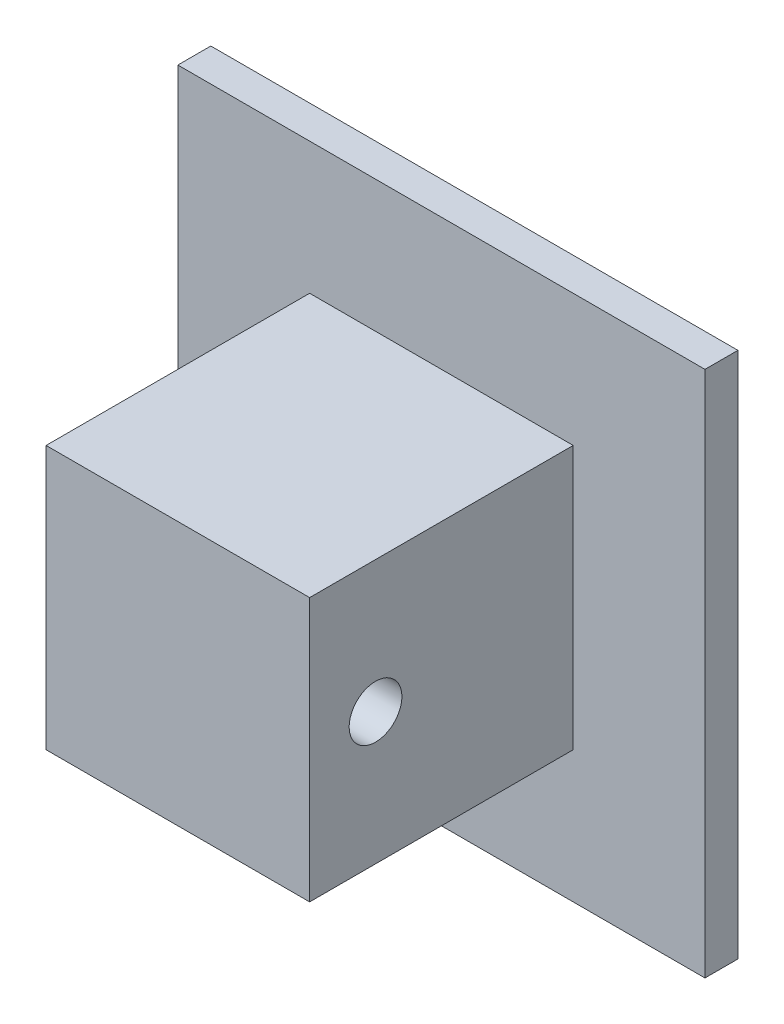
from build123d import *

# Parameters (mm, degrees)
ESQUISSE1_W             = 80
ESQUISSE1_H             = 80
EXTRUSION1_DEPTH        = 5
ESQUISSE2_W             = 40
ESQUISSE2_H             = 40
EXTRUSION2_DEPTH        = 40
ESQUISSE3_R             = 4
ENL_V_MAT_EXTRU_1_DEPTH = 110.658560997


with BuildPart() as part:
    # Esquisse1 → Extrusion1 (new body)
    with BuildSketch(Plane.XY):
        with Locations((40, 40)):
            Rectangle(ESQUISSE1_W, ESQUISSE1_H)
    extrude(amount=EXTRUSION1_DEPTH)

    # Esquisse2 → Extrusion2 (add)
    with BuildSketch(Plane.XY.offset(5)):
        with Locations((40, 40)):
            Rectangle(ESQUISSE2_W, ESQUISSE2_H)
    extrude(amount=EXTRUSION2_DEPTH)

    # Esquisse3 → Enl_v. mat.-Extru.1 (cut, through all)
    with BuildSketch(Plane.ZY.offset(-20)):
        with Locations(Location((35, 40, 0), (0, 0, 270))):
            Circle(ESQUISSE3_R)
    extrude(amount=-ENL_V_MAT_EXTRU_1_DEPTH, mode=Mode.SUBTRACT)


solid = part.part
